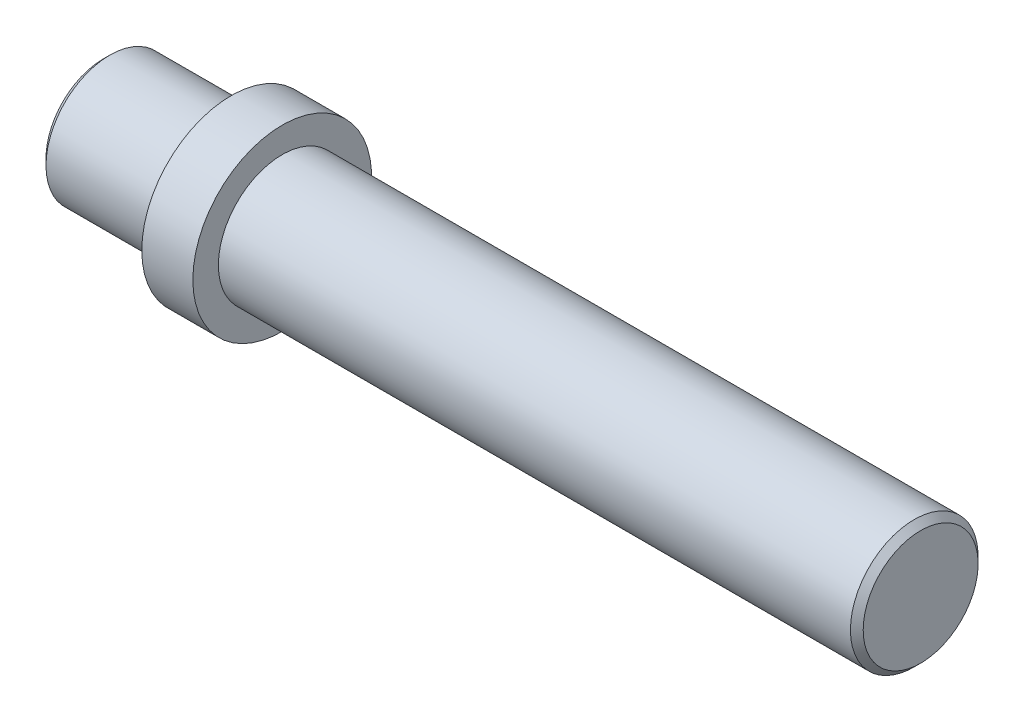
from build123d import *

# Parameters (mm, degrees)
CHANFREIN1_SIZE = 0.5


with BuildPart() as part:
    # Esquisse1 → Base-R_volution (revolve)
    with BuildSketch(Plane.XY, mode=Mode.PRIVATE) as base_r_volution_sk:
        Polygon((0, 0), (0, 5), (10, 5), (10, 7), (14, 7), (14, 5), (64, 5), (64, 0), align=None)
    revolve(base_r_volution_sk.sketch.rotate(Axis((0, 0, 0), (1, 0, 0)), 90), axis=Axis((0, 0, 0), (1, 0, 0)))

    # Chanfrein1
    chanfrein1_edges = [part.edges().sort_by_distance(p)[0] for p in [
        (0, 0, -5),
        (64, 0, -5),
    ]]
    chamfer(chanfrein1_edges, length=CHANFREIN1_SIZE)


solid = part.part
